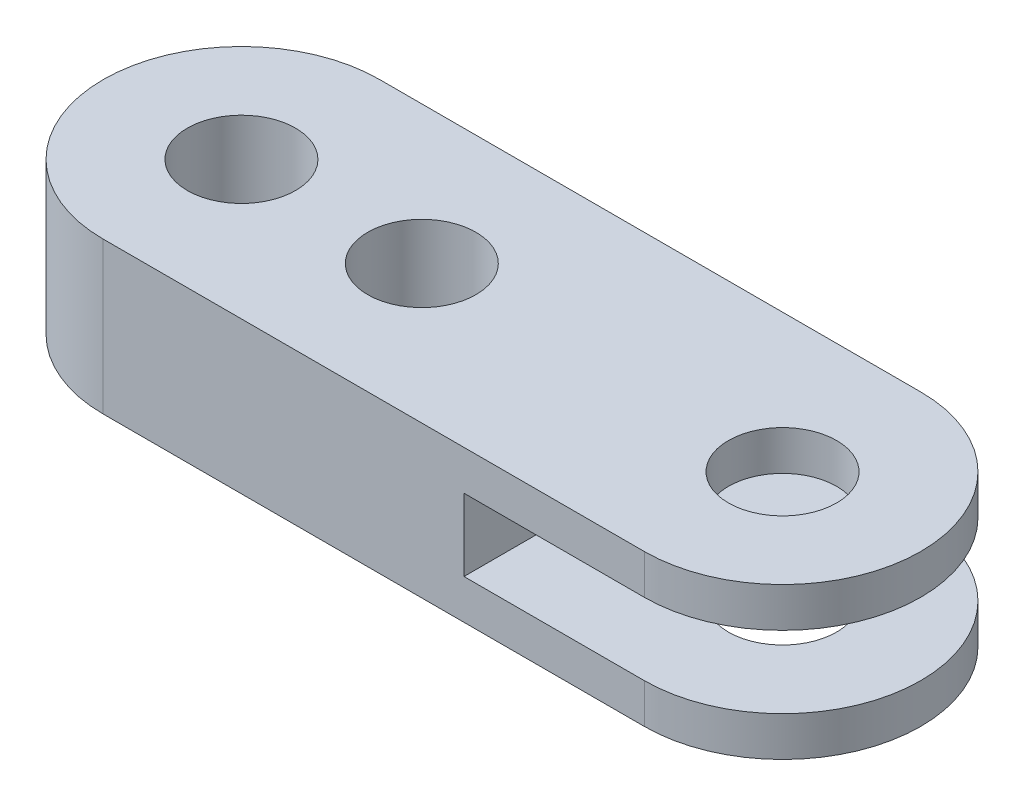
ISO-10303-21;
HEADER;
FILE_DESCRIPTION(('STEP AP214'),'2;1');
FILE_NAME('part.step','',(''),(''),'','','');
FILE_SCHEMA(('AUTOMOTIVE_DESIGN { 1 0 10303 214 1 1 1 1 }'));
ENDSEC;
DATA;
#1=APPLICATION_CONTEXT('core data for automotive mechanical design processes');
#2=APPLICATION_PROTOCOL_DEFINITION('international standard','automotive_design',2000,#1);
#3=PRODUCT_CONTEXT('',#1,'mechanical');
#4=PRODUCT('Part','Part','',(#3));
#5=PRODUCT_RELATED_PRODUCT_CATEGORY('part','',(#4));
#6=PRODUCT_DEFINITION_FORMATION('','',#4);
#7=PRODUCT_DEFINITION_CONTEXT('part definition',#1,'design');
#8=PRODUCT_DEFINITION('design','',#6,#7);
#9=PRODUCT_DEFINITION_SHAPE('','',#8);
#10=(LENGTH_UNIT() NAMED_UNIT(*) SI_UNIT(.MILLI.,.METRE.));
#11=(NAMED_UNIT(*) PLANE_ANGLE_UNIT() SI_UNIT($,.RADIAN.));
#12=(NAMED_UNIT(*) SI_UNIT($,.STERADIAN.) SOLID_ANGLE_UNIT());
#13=UNCERTAINTY_MEASURE_WITH_UNIT(LENGTH_MEASURE(1.E-05),#10,'distance_accuracy_value','');
#14=(GEOMETRIC_REPRESENTATION_CONTEXT(3) GLOBAL_UNCERTAINTY_ASSIGNED_CONTEXT((#13)) GLOBAL_UNIT_ASSIGNED_CONTEXT((#10,
#11,#12)) REPRESENTATION_CONTEXT('',''));
#15=CARTESIAN_POINT('',(0.,0.,0.));
#16=DIRECTION('',(0.,0.,1.));
#17=DIRECTION('',(1.,0.,0.));
#18=AXIS2_PLACEMENT_3D('',#15,#16,#17);
#19=CARTESIAN_POINT('',(15.,4.2,-3.83112189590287));
#20=DIRECTION('',(0.,-1.,0.));
#21=DIRECTION('',(0.,0.,-1.));
#22=AXIS2_PLACEMENT_3D('',#19,#20,#21);
#23=CYLINDRICAL_SURFACE('',#22,3.83112189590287);
#24=CARTESIAN_POINT('',(15.,3.1,-3.83112189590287));
#25=DIRECTION('',(0.,-1.,0.));
#26=DIRECTION('',(0.,0.,-1.));
#27=AXIS2_PLACEMENT_3D('',#24,#25,#26);
#28=CIRCLE('',#27,3.83112189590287);
#29=CARTESIAN_POINT('',(15.,3.1,0.));
#30=VERTEX_POINT('',#29);
#31=CARTESIAN_POINT('',(15.,3.1,-7.66224379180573));
#32=VERTEX_POINT('',#31);
#33=EDGE_CURVE('E211',#30,#32,#28,.F.);
#34=ORIENTED_EDGE('',*,*,#33,.T.);
#35=DIRECTION('',(0.,-1.,0.));
#36=VECTOR('',#35,1.);
#37=CARTESIAN_POINT('',(15.,4.2,-7.66224379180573));
#38=LINE('',#37,#36);
#39=CARTESIAN_POINT('',(15.,4.2,-7.66224379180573));
#40=VERTEX_POINT('',#39);
#41=EDGE_CURVE('E11',#40,#32,#38,.T.);
#42=ORIENTED_EDGE('',*,*,#41,.F.);
#43=CARTESIAN_POINT('',(15.,4.2,-3.83112189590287));
#44=DIRECTION('',(0.,1.,0.));
#45=DIRECTION('',(0.,0.,1.));
#46=AXIS2_PLACEMENT_3D('',#43,#44,#45);
#47=CIRCLE('',#46,3.83112189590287);
#48=CARTESIAN_POINT('',(15.,4.2,0.));
#49=VERTEX_POINT('',#48);
#50=EDGE_CURVE('E96',#49,#40,#47,.T.);
#51=ORIENTED_EDGE('',*,*,#50,.F.);
#52=DIRECTION('',(0.,-1.,0.));
#53=VECTOR('',#52,1.);
#54=CARTESIAN_POINT('',(15.,4.2,0.));
#55=LINE('',#54,#53);
#56=EDGE_CURVE('E151',#49,#30,#55,.T.);
#57=ORIENTED_EDGE('',*,*,#56,.T.);
#58=EDGE_LOOP('',(#34,#42,#51,#57));
#59=FACE_BOUND('',#58,.T.);
#60=ADVANCED_FACE('F45',(#59),#23,.T.);
#61=CARTESIAN_POINT('',(15.,1.1,-3.83112189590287));
#62=DIRECTION('',(0.,1.,0.));
#63=DIRECTION('',(0.,0.,1.));
#64=AXIS2_PLACEMENT_3D('',#61,#62,#63);
#65=CIRCLE('',#64,3.83112189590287);
#66=CARTESIAN_POINT('',(15.,1.1,-7.66224379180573));
#67=VERTEX_POINT('',#66);
#68=CARTESIAN_POINT('',(15.,1.1,0.));
#69=VERTEX_POINT('',#68);
#70=EDGE_CURVE('E120',#67,#69,#65,.F.);
#71=ORIENTED_EDGE('',*,*,#70,.T.);
#72=CARTESIAN_POINT('',(15.,0.,0.));
#73=VERTEX_POINT('',#72);
#74=EDGE_CURVE('E91',#69,#73,#55,.T.);
#75=ORIENTED_EDGE('',*,*,#74,.T.);
#76=CARTESIAN_POINT('',(15.,0.,-3.83112189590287));
#77=DIRECTION('',(0.,1.,0.));
#78=DIRECTION('',(0.,0.,1.));
#79=AXIS2_PLACEMENT_3D('',#76,#77,#78);
#80=CIRCLE('',#79,3.83112189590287);
#81=CARTESIAN_POINT('',(15.,0.,-7.66224379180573));
#82=VERTEX_POINT('',#81);
#83=EDGE_CURVE('E140',#73,#82,#80,.T.);
#84=ORIENTED_EDGE('',*,*,#83,.T.);
#85=EDGE_CURVE('E53',#67,#82,#38,.T.);
#86=ORIENTED_EDGE('',*,*,#85,.F.);
#87=EDGE_LOOP('',(#71,#75,#84,#86));
#88=FACE_BOUND('',#87,.T.);
#89=ADVANCED_FACE('F138',(#88),#23,.T.);
#90=CARTESIAN_POINT('',(0.,4.2,-7.66224379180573));
#91=DIRECTION('',(0.,0.,-1.));
#92=DIRECTION('',(-1.,0.,0.));
#93=AXIS2_PLACEMENT_3D('',#90,#91,#92);
#94=PLANE('',#93);
#95=ORIENTED_EDGE('',*,*,#41,.T.);
#96=DIRECTION('',(-1.,0.,0.));
#97=VECTOR('',#96,1.);
#98=CARTESIAN_POINT('',(18.8321218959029,3.1,-7.66224379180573));
#99=LINE('',#98,#97);
#100=CARTESIAN_POINT('',(10.,3.1,-7.66224379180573));
#101=VERTEX_POINT('',#100);
#102=EDGE_CURVE('E136',#32,#101,#99,.T.);
#103=ORIENTED_EDGE('',*,*,#102,.T.);
#104=DIRECTION('',(0.,1.,0.));
#105=VECTOR('',#104,1.);
#106=CARTESIAN_POINT('',(10.,1.1,-7.66224379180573));
#107=LINE('',#106,#105);
#108=CARTESIAN_POINT('',(10.,1.1,-7.66224379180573));
#109=VERTEX_POINT('',#108);
#110=EDGE_CURVE('E134',#109,#101,#107,.T.);
#111=ORIENTED_EDGE('',*,*,#110,.F.);
#112=DIRECTION('',(-1.,0.,0.));
#113=VECTOR('',#112,1.);
#114=CARTESIAN_POINT('',(18.8321218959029,1.1,-7.66224379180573));
#115=LINE('',#114,#113);
#116=EDGE_CURVE('E123',#67,#109,#115,.T.);
#117=ORIENTED_EDGE('',*,*,#116,.F.);
#118=ORIENTED_EDGE('',*,*,#85,.T.);
#119=DIRECTION('',(1.,0.,0.));
#120=VECTOR('',#119,1.);
#121=CARTESIAN_POINT('',(0.,0.,-7.66224379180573));
#122=LINE('',#121,#120);
#123=CARTESIAN_POINT('',(0.,0.,-7.66224379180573));
#124=VERTEX_POINT('',#123);
#125=EDGE_CURVE('E175',#124,#82,#122,.T.);
#126=ORIENTED_EDGE('',*,*,#125,.F.);
#127=DIRECTION('',(0.,-1.,0.));
#128=VECTOR('',#127,1.);
#129=CARTESIAN_POINT('',(0.,4.2,-7.66224379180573));
#130=LINE('',#129,#128);
#131=CARTESIAN_POINT('',(0.,4.2,-7.66224379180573));
#132=VERTEX_POINT('',#131);
#133=EDGE_CURVE('E143',#132,#124,#130,.T.);
#134=ORIENTED_EDGE('',*,*,#133,.F.);
#135=DIRECTION('',(1.,0.,0.));
#136=VECTOR('',#135,1.);
#137=CARTESIAN_POINT('',(0.,4.2,-7.66224379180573));
#138=LINE('',#137,#136);
#139=EDGE_CURVE('E198',#132,#40,#138,.T.);
#140=ORIENTED_EDGE('',*,*,#139,.T.);
#141=EDGE_LOOP('',(#95,#103,#111,#117,#118,#126,#134,#140));
#142=FACE_BOUND('',#141,.T.);
#143=ADVANCED_FACE('F131',(#142),#94,.T.);
#144=CARTESIAN_POINT('',(15.,4.2,-3.83112189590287));
#145=DIRECTION('',(0.,-1.,0.));
#146=DIRECTION('',(0.,0.,-1.));
#147=AXIS2_PLACEMENT_3D('',#144,#145,#146);
#148=CYLINDRICAL_SURFACE('',#147,1.5);
#149=CARTESIAN_POINT('',(15.,4.2,-3.83112189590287));
#150=DIRECTION('',(0.,1.,0.));
#151=DIRECTION('',(0.,0.,1.));
#152=AXIS2_PLACEMENT_3D('',#149,#150,#151);
#153=CIRCLE('',#152,1.5);
#154=CARTESIAN_POINT('',(15.,4.2,-2.33112189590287));
#155=VERTEX_POINT('',#154);
#156=EDGE_CURVE('E189',#155,#155,#153,.T.);
#157=ORIENTED_EDGE('',*,*,#156,.T.);
#158=EDGE_LOOP('',(#157));
#159=FACE_BOUND('',#158,.T.);
#160=CARTESIAN_POINT('',(15.,3.1,-3.83112189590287));
#161=DIRECTION('',(0.,-1.,0.));
#162=DIRECTION('',(0.,0.,-1.));
#163=AXIS2_PLACEMENT_3D('',#160,#161,#162);
#164=CIRCLE('',#163,1.5);
#165=CARTESIAN_POINT('',(15.,3.1,-5.33112189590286));
#166=VERTEX_POINT('',#165);
#167=EDGE_CURVE('E180',#166,#166,#164,.T.);
#168=ORIENTED_EDGE('',*,*,#167,.T.);
#169=EDGE_LOOP('',(#168));
#170=FACE_BOUND('',#169,.T.);
#171=ADVANCED_FACE('F283',(#159,#170),#148,.F.);
#172=CARTESIAN_POINT('',(15.,0.,-3.83112189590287));
#173=DIRECTION('',(0.,1.,0.));
#174=DIRECTION('',(0.,0.,1.));
#175=AXIS2_PLACEMENT_3D('',#172,#173,#174);
#176=CIRCLE('',#175,1.5);
#177=CARTESIAN_POINT('',(15.,0.,-2.33112189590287));
#178=VERTEX_POINT('',#177);
#179=EDGE_CURVE('E165',#178,#178,#176,.T.);
#180=ORIENTED_EDGE('',*,*,#179,.F.);
#181=EDGE_LOOP('',(#180));
#182=FACE_BOUND('',#181,.T.);
#183=CARTESIAN_POINT('',(15.,1.1,-3.83112189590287));
#184=DIRECTION('',(0.,1.,0.));
#185=DIRECTION('',(0.,0.,1.));
#186=AXIS2_PLACEMENT_3D('',#183,#184,#185);
#187=CIRCLE('',#186,1.5);
#188=CARTESIAN_POINT('',(15.,1.1,-2.33112189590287));
#189=VERTEX_POINT('',#188);
#190=EDGE_CURVE('E207',#189,#189,#187,.T.);
#191=ORIENTED_EDGE('',*,*,#190,.T.);
#192=EDGE_LOOP('',(#191));
#193=FACE_BOUND('',#192,.T.);
#194=ADVANCED_FACE('F285',(#182,#193),#148,.F.);
#195=CARTESIAN_POINT('',(0.,4.2,0.));
#196=DIRECTION('',(0.,0.,-1.));
#197=DIRECTION('',(-1.,0.,0.));
#198=AXIS2_PLACEMENT_3D('',#195,#196,#197);
#199=PLANE('',#198);
#200=DIRECTION('',(-1.,0.,0.));
#201=VECTOR('',#200,1.);
#202=CARTESIAN_POINT('',(18.8321218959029,3.1,0.));
#203=LINE('',#202,#201);
#204=CARTESIAN_POINT('',(10.,3.1,0.));
#205=VERTEX_POINT('',#204);
#206=EDGE_CURVE('E219',#30,#205,#203,.T.);
#207=ORIENTED_EDGE('',*,*,#206,.F.);
#208=ORIENTED_EDGE('',*,*,#56,.F.);
#209=DIRECTION('',(1.,0.,0.));
#210=VECTOR('',#209,1.);
#211=CARTESIAN_POINT('',(0.,4.2,0.));
#212=LINE('',#211,#210);
#213=CARTESIAN_POINT('',(0.,4.2,0.));
#214=VERTEX_POINT('',#213);
#215=EDGE_CURVE('E69',#214,#49,#212,.T.);
#216=ORIENTED_EDGE('',*,*,#215,.F.);
#217=DIRECTION('',(0.,-1.,0.));
#218=VECTOR('',#217,1.);
#219=CARTESIAN_POINT('',(0.,4.2,0.));
#220=LINE('',#219,#218);
#221=CARTESIAN_POINT('',(0.,0.,0.));
#222=VERTEX_POINT('',#221);
#223=EDGE_CURVE('E145',#214,#222,#220,.T.);
#224=ORIENTED_EDGE('',*,*,#223,.T.);
#225=DIRECTION('',(1.,0.,0.));
#226=VECTOR('',#225,1.);
#227=CARTESIAN_POINT('',(0.,0.,0.));
#228=LINE('',#227,#226);
#229=EDGE_CURVE('E169',#222,#73,#228,.T.);
#230=ORIENTED_EDGE('',*,*,#229,.T.);
#231=ORIENTED_EDGE('',*,*,#74,.F.);
#232=DIRECTION('',(-1.,0.,0.));
#233=VECTOR('',#232,1.);
#234=CARTESIAN_POINT('',(18.8321218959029,1.1,0.));
#235=LINE('',#234,#233);
#236=CARTESIAN_POINT('',(10.,1.1,0.));
#237=VERTEX_POINT('',#236);
#238=EDGE_CURVE('E125',#69,#237,#235,.T.);
#239=ORIENTED_EDGE('',*,*,#238,.T.);
#240=DIRECTION('',(0.,-1.,0.));
#241=VECTOR('',#240,1.);
#242=CARTESIAN_POINT('',(10.,1.1,0.));
#243=LINE('',#242,#241);
#244=EDGE_CURVE('E60',#205,#237,#243,.T.);
#245=ORIENTED_EDGE('',*,*,#244,.F.);
#246=EDGE_LOOP('',(#207,#208,#216,#224,#230,#231,#239,#245));
#247=FACE_BOUND('',#246,.T.);
#248=ADVANCED_FACE('F236',(#247),#199,.F.);
#249=CARTESIAN_POINT('',(0.,4.2,-3.83112189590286));
#250=DIRECTION('',(0.,-1.,0.));
#251=DIRECTION('',(0.,0.,-1.));
#252=AXIS2_PLACEMENT_3D('',#249,#250,#251);
#253=CYLINDRICAL_SURFACE('',#252,3.83112189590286);
#254=CARTESIAN_POINT('',(0.,0.,-3.83112189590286));
#255=DIRECTION('',(0.,1.,0.));
#256=DIRECTION('',(0.,0.,1.));
#257=AXIS2_PLACEMENT_3D('',#254,#255,#256);
#258=CIRCLE('',#257,3.83112189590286);
#259=EDGE_CURVE('E172',#124,#222,#258,.T.);
#260=ORIENTED_EDGE('',*,*,#259,.T.);
#261=ORIENTED_EDGE('',*,*,#223,.F.);
#262=CARTESIAN_POINT('',(0.,4.2,-3.83112189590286));
#263=DIRECTION('',(0.,1.,0.));
#264=DIRECTION('',(0.,0.,1.));
#265=AXIS2_PLACEMENT_3D('',#262,#263,#264);
#266=CIRCLE('',#265,3.83112189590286);
#267=EDGE_CURVE('E195',#132,#214,#266,.T.);
#268=ORIENTED_EDGE('',*,*,#267,.F.);
#269=ORIENTED_EDGE('',*,*,#133,.T.);
#270=EDGE_LOOP('',(#260,#261,#268,#269));
#271=FACE_BOUND('',#270,.T.);
#272=ADVANCED_FACE('F242',(#271),#253,.T.);
#273=CARTESIAN_POINT('',(5.,4.2,-3.83112189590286));
#274=DIRECTION('',(0.,-1.,0.));
#275=DIRECTION('',(0.,0.,-1.));
#276=AXIS2_PLACEMENT_3D('',#273,#274,#275);
#277=CYLINDRICAL_SURFACE('',#276,1.5);
#278=CARTESIAN_POINT('',(5.,4.2,-3.83112189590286));
#279=DIRECTION('',(0.,1.,0.));
#280=DIRECTION('',(0.,0.,1.));
#281=AXIS2_PLACEMENT_3D('',#278,#279,#280);
#282=CIRCLE('',#281,1.5);
#283=CARTESIAN_POINT('',(5.,4.2,-2.33112189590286));
#284=VERTEX_POINT('',#283);
#285=EDGE_CURVE('E185',#284,#284,#282,.T.);
#286=ORIENTED_EDGE('',*,*,#285,.T.);
#287=EDGE_LOOP('',(#286));
#288=FACE_BOUND('',#287,.T.);
#289=CARTESIAN_POINT('',(5.,0.,-3.83112189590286));
#290=DIRECTION('',(0.,1.,0.));
#291=DIRECTION('',(0.,0.,1.));
#292=AXIS2_PLACEMENT_3D('',#289,#290,#291);
#293=CIRCLE('',#292,1.5);
#294=CARTESIAN_POINT('',(5.,0.,-2.33112189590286));
#295=VERTEX_POINT('',#294);
#296=EDGE_CURVE('E161',#295,#295,#293,.T.);
#297=ORIENTED_EDGE('',*,*,#296,.F.);
#298=EDGE_LOOP('',(#297));
#299=FACE_BOUND('',#298,.T.);
#300=ADVANCED_FACE('F256',(#288,#299),#277,.F.);
#301=CARTESIAN_POINT('',(0.,4.2,-3.83112189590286));
#302=DIRECTION('',(0.,-1.,0.));
#303=DIRECTION('',(0.,0.,-1.));
#304=AXIS2_PLACEMENT_3D('',#301,#302,#303);
#305=CYLINDRICAL_SURFACE('',#304,1.5);
#306=CARTESIAN_POINT('',(0.,4.2,-3.83112189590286));
#307=DIRECTION('',(0.,1.,0.));
#308=DIRECTION('',(0.,0.,1.));
#309=AXIS2_PLACEMENT_3D('',#306,#307,#308);
#310=CIRCLE('',#309,1.5);
#311=CARTESIAN_POINT('',(0.,4.2,-2.33112189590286));
#312=VERTEX_POINT('',#311);
#313=EDGE_CURVE('E181',#312,#312,#310,.T.);
#314=ORIENTED_EDGE('',*,*,#313,.T.);
#315=EDGE_LOOP('',(#314));
#316=FACE_BOUND('',#315,.T.);
#317=CARTESIAN_POINT('',(0.,0.,-3.83112189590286));
#318=DIRECTION('',(0.,1.,0.));
#319=DIRECTION('',(0.,0.,1.));
#320=AXIS2_PLACEMENT_3D('',#317,#318,#319);
#321=CIRCLE('',#320,1.5);
#322=CARTESIAN_POINT('',(0.,0.,-2.33112189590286));
#323=VERTEX_POINT('',#322);
#324=EDGE_CURVE('E157',#323,#323,#321,.T.);
#325=ORIENTED_EDGE('',*,*,#324,.F.);
#326=EDGE_LOOP('',(#325));
#327=FACE_BOUND('',#326,.T.);
#328=ADVANCED_FACE('F246',(#316,#327),#305,.F.);
#329=CARTESIAN_POINT('',(0.,4.2,0.));
#330=DIRECTION('',(0.,1.,0.));
#331=DIRECTION('',(0.,0.,1.));
#332=AXIS2_PLACEMENT_3D('',#329,#330,#331);
#333=PLANE('',#332);
#334=ORIENTED_EDGE('',*,*,#50,.T.);
#335=ORIENTED_EDGE('',*,*,#139,.F.);
#336=ORIENTED_EDGE('',*,*,#267,.T.);
#337=ORIENTED_EDGE('',*,*,#215,.T.);
#338=EDGE_LOOP('',(#334,#335,#336,#337));
#339=FACE_BOUND('',#338,.T.);
#340=ORIENTED_EDGE('',*,*,#156,.F.);
#341=EDGE_LOOP('',(#340));
#342=FACE_BOUND('',#341,.T.);
#343=ORIENTED_EDGE('',*,*,#285,.F.);
#344=EDGE_LOOP('',(#343));
#345=FACE_BOUND('',#344,.T.);
#346=ORIENTED_EDGE('',*,*,#313,.F.);
#347=EDGE_LOOP('',(#346));
#348=FACE_BOUND('',#347,.T.);
#349=ADVANCED_FACE('F243',(#339,#342,#345,#348),#333,.T.);
#350=CARTESIAN_POINT('',(0.,0.,0.));
#351=DIRECTION('',(0.,1.,0.));
#352=DIRECTION('',(0.,0.,1.));
#353=AXIS2_PLACEMENT_3D('',#350,#351,#352);
#354=PLANE('',#353);
#355=ORIENTED_EDGE('',*,*,#83,.F.);
#356=ORIENTED_EDGE('',*,*,#229,.F.);
#357=ORIENTED_EDGE('',*,*,#259,.F.);
#358=ORIENTED_EDGE('',*,*,#125,.T.);
#359=EDGE_LOOP('',(#355,#356,#357,#358));
#360=FACE_BOUND('',#359,.T.);
#361=ORIENTED_EDGE('',*,*,#179,.T.);
#362=EDGE_LOOP('',(#361));
#363=FACE_BOUND('',#362,.T.);
#364=ORIENTED_EDGE('',*,*,#296,.T.);
#365=EDGE_LOOP('',(#364));
#366=FACE_BOUND('',#365,.T.);
#367=ORIENTED_EDGE('',*,*,#324,.T.);
#368=EDGE_LOOP('',(#367));
#369=FACE_BOUND('',#368,.T.);
#370=ADVANCED_FACE('F240',(#360,#363,#366,#369),#354,.F.);
#371=CARTESIAN_POINT('',(10.,0.,0.));
#372=DIRECTION('',(1.,0.,0.));
#373=DIRECTION('',(0.,0.,-1.));
#374=AXIS2_PLACEMENT_3D('',#371,#372,#373);
#375=PLANE('',#374);
#376=ORIENTED_EDGE('',*,*,#244,.T.);
#377=DIRECTION('',(0.,0.,-1.));
#378=VECTOR('',#377,1.);
#379=CARTESIAN_POINT('',(10.,1.1,-7.66224379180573));
#380=LINE('',#379,#378);
#381=EDGE_CURVE('E227',#237,#109,#380,.T.);
#382=ORIENTED_EDGE('',*,*,#381,.T.);
#383=ORIENTED_EDGE('',*,*,#110,.T.);
#384=DIRECTION('',(0.,0.,1.));
#385=VECTOR('',#384,1.);
#386=CARTESIAN_POINT('',(10.,3.1,-7.66224379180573));
#387=LINE('',#386,#385);
#388=EDGE_CURVE('E222',#101,#205,#387,.T.);
#389=ORIENTED_EDGE('',*,*,#388,.T.);
#390=EDGE_LOOP('',(#376,#382,#383,#389));
#391=FACE_BOUND('',#390,.T.);
#392=ADVANCED_FACE('F232',(#391),#375,.T.);
#393=CARTESIAN_POINT('',(18.8321218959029,3.1,-7.66224379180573));
#394=DIRECTION('',(0.,-1.,0.));
#395=DIRECTION('',(0.,0.,-1.));
#396=AXIS2_PLACEMENT_3D('',#393,#394,#395);
#397=PLANE('',#396);
#398=ORIENTED_EDGE('',*,*,#167,.F.);
#399=EDGE_LOOP('',(#398));
#400=FACE_BOUND('',#399,.T.);
#401=ORIENTED_EDGE('',*,*,#206,.T.);
#402=ORIENTED_EDGE('',*,*,#388,.F.);
#403=ORIENTED_EDGE('',*,*,#102,.F.);
#404=ORIENTED_EDGE('',*,*,#33,.F.);
#405=EDGE_LOOP('',(#401,#402,#403,#404));
#406=FACE_BOUND('',#405,.T.);
#407=ADVANCED_FACE('F265',(#400,#406),#397,.T.);
#408=CARTESIAN_POINT('',(18.8321218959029,1.1,-7.66224379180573));
#409=DIRECTION('',(0.,1.,0.));
#410=DIRECTION('',(0.,0.,1.));
#411=AXIS2_PLACEMENT_3D('',#408,#409,#410);
#412=PLANE('',#411);
#413=ORIENTED_EDGE('',*,*,#190,.F.);
#414=EDGE_LOOP('',(#413));
#415=FACE_BOUND('',#414,.T.);
#416=ORIENTED_EDGE('',*,*,#116,.T.);
#417=ORIENTED_EDGE('',*,*,#381,.F.);
#418=ORIENTED_EDGE('',*,*,#238,.F.);
#419=ORIENTED_EDGE('',*,*,#70,.F.);
#420=EDGE_LOOP('',(#416,#417,#418,#419));
#421=FACE_BOUND('',#420,.T.);
#422=ADVANCED_FACE('F122',(#415,#421),#412,.T.);
#423=CLOSED_SHELL('',(#60,#89,#143,#171,#194,#248,#272,#300,#328,#349,#370,#392,#407,#422));
#424=MANIFOLD_SOLID_BREP('B2',#423);
#425=ADVANCED_BREP_SHAPE_REPRESENTATION('',(#18,#424),#14);
#426=SHAPE_DEFINITION_REPRESENTATION(#9,#425);
ENDSEC;
END-ISO-10303-21;
